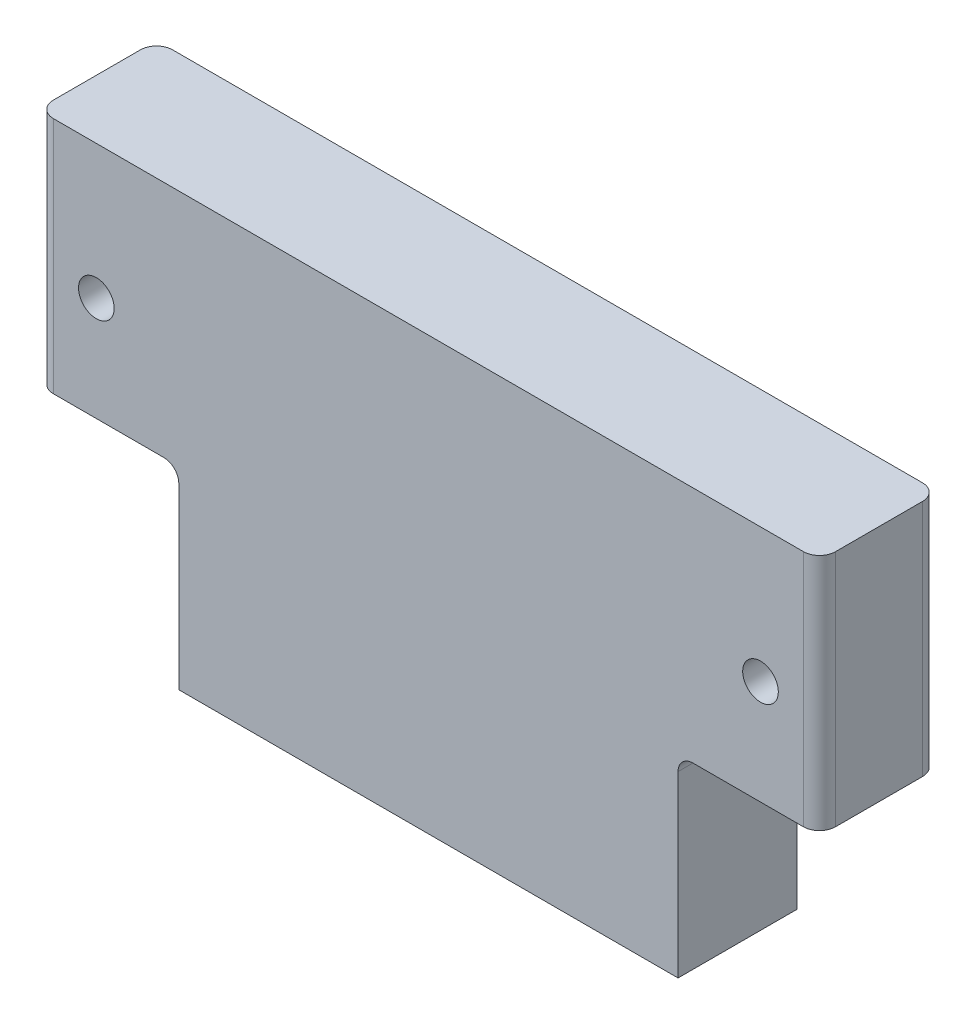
from build123d import *

# Parameters (mm, degrees)
SKETCH1_W              = 83.3628
SKETCH1_H              = 25.4
BOSS_EXTRUDE1_DEPTH    = 6.35
F_10_24_TAPPED_HOLE1_D = 3.7973
SKETCH6_W              = 53.213
SKETCH6_H              = 20.6375
BOSS_EXTRUDE2_DEPTH    = 12.7
FILLET1_R              = 1.7145
FILLET2_R              = 1.5875


with BuildPart() as part:
    # Sketch1 → Boss-Extrude1 (new, symmetric)
    with BuildSketch(Plane.XY):
        Rectangle(SKETCH1_W, SKETCH1_H)
    extrude(amount=BOSS_EXTRUDE1_DEPTH, both=True)

    # 10-24 Tapped Hole1 (through all)
    with Locations(Plane.XY.offset(6.35)):
        with Locations((-35.3949, -1.5875), (35.3949, -1.5875)):
            Hole(F_10_24_TAPPED_HOLE1_D / 2)

    # Sketch6 → Boss-Extrude2 (add)
    with BuildSketch(Plane.XY.offset(6.35)):
        with Locations((0, -23.01875)):
            Rectangle(SKETCH6_W, SKETCH6_H)
    extrude(amount=-BOSS_EXTRUDE2_DEPTH)

    # Fillet1
    fillet1_edges = [part.edges().sort_by_distance(p)[0] for p in [
        (-41.6814, 0, 6.35),
        (41.6814, 0, 6.35),
        (-41.6814, 0, -6.35),
        (41.6814, 0, -6.35),
    ]]
    fillet(fillet1_edges, radius=FILLET1_R)

    # Fillet2
    fillet2_edges = [part.edges().sort_by_distance(p)[0] for p in [
        (-26.6065, -12.7, 0),
        (26.6065, -12.7, 0),
    ]]
    fillet(fillet2_edges, radius=FILLET2_R)


solid = part.part
